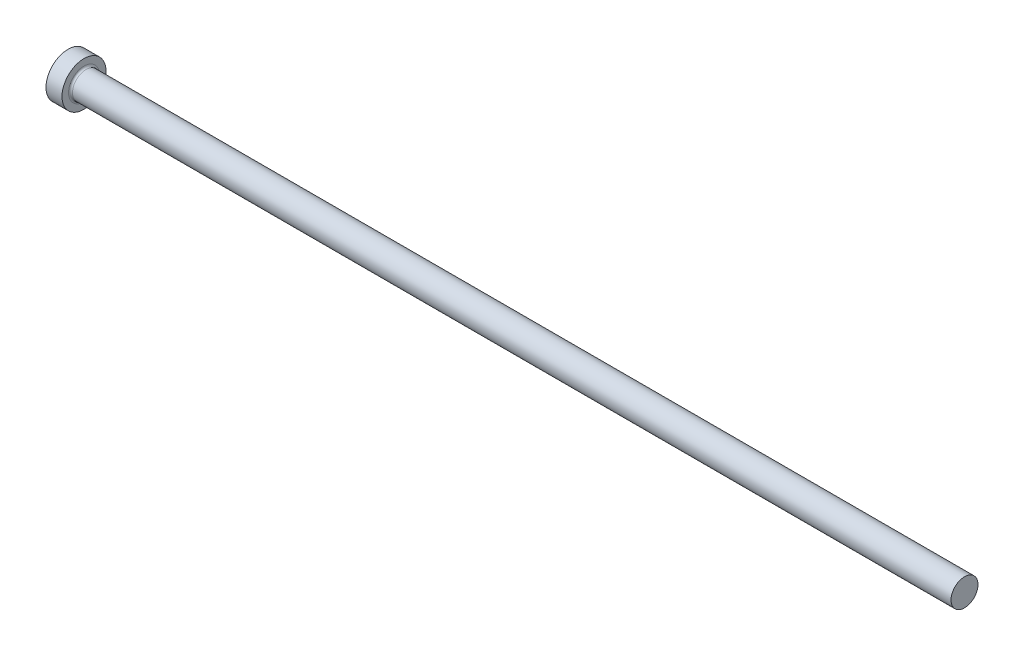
from build123d import *


with BuildPart() as part:
    # Sketch1 → PIN (revolve)
    with BuildSketch(Plane.XY, mode=Mode.PRIVATE) as pin_sk:
        with BuildLine():
            Line((0, 0), (0, 8.73125))
            Line((0, 8.73125), (6.35, 8.73125))
            Line((6.35, 8.73125), (6.35, 6.13918))
            ThreePointArc((6.35, 6.13918), (6.58062412, 5.58240412), (7.1374, 5.35178))
            Line((7.1374, 5.35178), (355.6, 5.35178))
            Line((355.6, 5.35178), (355.6, 0))
            Line((355.6, 0), (0, 0))
        make_face()
    revolve(pin_sk.sketch.rotate(Axis((355.6, 0, 0), (-1, 0, 0)), 180), axis=Axis((355.6, 0, 0), (-1, 0, 0)))


solid = part.part
